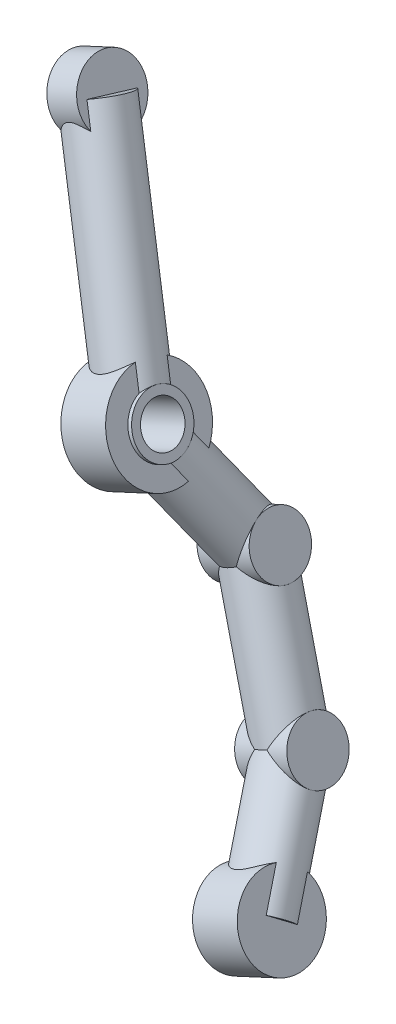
from build123d import *

# Parameters (mm, degrees)
BRAZO_1_PROFILE_R        = 3.5
BRAZO_2_PROFILE_R        = 3.5
BRAZO_3_PROFILE_R        = 3.5
BRAZO_4_PROFILE_R        = 3.5
BRAZO_CODO_1_PROFILE_R   = 3.5
BRAZO_CODO_2_PROFILE_R   = 3.5
BRAZO_CODO_3_PROFILE_R   = 3.5
OJO_PIVOTE_PROFILE_R     = 6
ANCLAJE_CABLE_PROFILE_R  = 4
OJO_ZAPATA_PROFILE_R     = 5
TALADRO_PIVOTE_PROFILE_R = 2.5


with BuildPart() as part:
    # Brazo_1: sweep along a curve in space
    with BuildLine() as brazo_1_path:
        Line((424.61087669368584, 411.57911876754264, -33), (436.3979905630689, 386.1810096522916, -26))
    # Brazo_1 profile (on start of the path) → Brazo_1 (sweep)
    with BuildSketch(Plane(origin=(424.61087669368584, 411.57911876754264, -33), x_dir=(-0.9070753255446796, -0.42096835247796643, 0), z_dir=(0.40839928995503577, -0.8799923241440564, 0.24253562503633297))):
        Circle(BRAZO_1_PROFILE_R)
    sweep(path=brazo_1_path.line)

    # Brazo_2: sweep along a curve in space
    with BuildLine() as brazo_2_path:
        Line((436.3979905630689, 386.1810096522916, -26), (442.7125158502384, 372.5748797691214, -34))
    # Brazo_2 profile (on start of the path) → Brazo_2 (sweep)
    with BuildSketch(Plane(origin=(436.3979905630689, 386.1810096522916, -26), x_dir=(0, 0.5068503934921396, -0.8620340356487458), z_dir=(0.37144266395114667, -0.8003605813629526, -0.47058823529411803))):
        Circle(BRAZO_2_PROFILE_R)
    sweep(path=brazo_2_path.line)

    # Brazo_3: sweep along a curve in space
    with BuildLine() as brazo_3_path:
        Line((442.7125158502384, 372.5748797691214, -34), (450.28994619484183, 356.2475239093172, -31))
    # Brazo_3 profile (on start of the path) → Brazo_3 (sweep)
    with BuildSketch(Plane(origin=(442.7125158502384, 372.5748797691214, -34), x_dir=(-0.9070753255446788, -0.42096835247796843, 0), z_dir=(0.4152406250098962, -0.8947335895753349, 0.16439898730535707))):
        Circle(BRAZO_3_PROFILE_R)
    sweep(path=brazo_3_path.line)

    # Brazo_4: sweep along a curve in space
    with BuildLine() as brazo_4_path:
        Line((450.28994619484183, 356.2475239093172, -31), (455.3415664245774, 345.36262000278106, -22))
    # Brazo_4 profile (on start of the path) → Brazo_4 (sweep)
    with BuildSketch(Plane(origin=(450.28994619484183, 356.2475239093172, -31), x_dir=(0, -0.6372232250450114, -0.7706792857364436), z_dir=(0.33677468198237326, -0.7256602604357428, 0.600000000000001))):
        Circle(BRAZO_4_PROFILE_R)
    sweep(path=brazo_4_path.line)

    # Brazo_codo_1: sweep along a curve in space
    with BuildLine() as brazo_codo_1_path:
        Line((433.22322692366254, 384.7076204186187, -26), (439.57275420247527, 387.6543988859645, -26))
    # Brazo_codo_1 profile (on start of the path) → Brazo_codo_1 (sweep)
    with BuildSketch(Plane(origin=(433.22322692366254, 384.7076204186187, -26), x_dir=(-0.42096835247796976, 0.9070753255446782, 0), z_dir=(0.9070753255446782, 0.42096835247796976, 0))):
        Circle(BRAZO_CODO_1_PROFILE_R)
    sweep(path=brazo_codo_1_path.line)

    # Brazo_codo_2: sweep along a curve in space
    with BuildLine() as brazo_codo_2_path:
        Line((439.537752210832, 371.10149053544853, -34), (445.88727948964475, 374.0482690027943, -34))
    # Brazo_codo_2 profile (on start of the path) → Brazo_codo_2 (sweep)
    with BuildSketch(Plane(origin=(439.537752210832, 371.10149053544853, -34), x_dir=(-0.42096835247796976, 0.9070753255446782, 0), z_dir=(0.9070753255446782, 0.42096835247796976, 0))):
        Circle(BRAZO_CODO_2_PROFILE_R)
    sweep(path=brazo_codo_2_path.line)

    # Brazo_codo_3: sweep along a curve in space
    with BuildLine() as brazo_codo_3_path:
        Line((447.11518255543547, 354.7741346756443, -31), (453.4647098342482, 357.72091314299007, -31))
    # Brazo_codo_3 profile (on start of the path) → Brazo_codo_3 (sweep)
    with BuildSketch(Plane(origin=(447.11518255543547, 354.7741346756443, -31), x_dir=(-0.42096835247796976, 0.9070753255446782, 0), z_dir=(0.9070753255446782, 0.42096835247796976, 0))):
        Circle(BRAZO_CODO_3_PROFILE_R)
    sweep(path=brazo_codo_3_path.line)

    # Ojo_pivote: sweep along a curve in space
    with BuildLine() as ojo_pivote_path:
        Line((433.67676458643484, 384.9181045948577, -26), (439.11921653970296, 387.4439147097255, -26))
    # Ojo_pivote profile (on start of the path) → Ojo_pivote (sweep)
    with BuildSketch(Plane(origin=(433.67676458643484, 384.9181045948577, -26), x_dir=(-0.4209683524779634, 0.9070753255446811, 0), z_dir=(0.9070753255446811, 0.4209683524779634, 0))):
        Circle(OJO_PIVOTE_PROFILE_R)
    sweep(path=ojo_pivote_path.line)

    # Anclaje_cable: sweep along a curve in space
    with BuildLine() as anclaje_cable_path:
        Line((422.79672604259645, 410.7371820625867, -33), (426.4250273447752, 412.4210554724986, -33))
    # Anclaje_cable profile (on start of the path) → Anclaje_cable (sweep)
    with BuildSketch(Plane(origin=(422.79672604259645, 410.7371820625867, -33), x_dir=(-0.4209683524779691, 0.9070753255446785, 0), z_dir=(0.9070753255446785, 0.4209683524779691, 0))):
        Circle(ANCLAJE_CABLE_PROFILE_R)
    sweep(path=anclaje_cable_path.line)

    # Ojo_zapata: sweep along a curve in space
    with BuildLine() as ojo_zapata_path:
        Line((452.62034044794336, 344.09971494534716, -22), (458.0627924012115, 346.62552506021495, -22))
    # Ojo_zapata profile (on start of the path) → Ojo_zapata (sweep)
    with BuildSketch(Plane(origin=(452.62034044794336, 344.09971494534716, -22), x_dir=(-0.4209683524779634, 0.9070753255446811, 0), z_dir=(0.9070753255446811, 0.4209683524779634, 0))):
        Circle(OJO_ZAPATA_PROFILE_R)
    sweep(path=ojo_zapata_path.line)

    # Taladro_pivote: sweep along a curve in space
    with BuildLine() as taladro_pivote_path:
        Line((432.7696892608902, 384.4971362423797, -26), (440.02629186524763, 387.8648830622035, -26))
    # Taladro_pivote profile (on start of the path) → Taladro_pivote (sweep, cut)
    with BuildSketch(Plane(origin=(432.7696892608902, 384.4971362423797, -26), x_dir=(-0.4209683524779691, 0.9070753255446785, 0), z_dir=(0.9070753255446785, 0.4209683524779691, 0))):
        Circle(TALADRO_PIVOTE_PROFILE_R)
    sweep(path=taladro_pivote_path.line, mode=Mode.SUBTRACT)


solid = part.part
